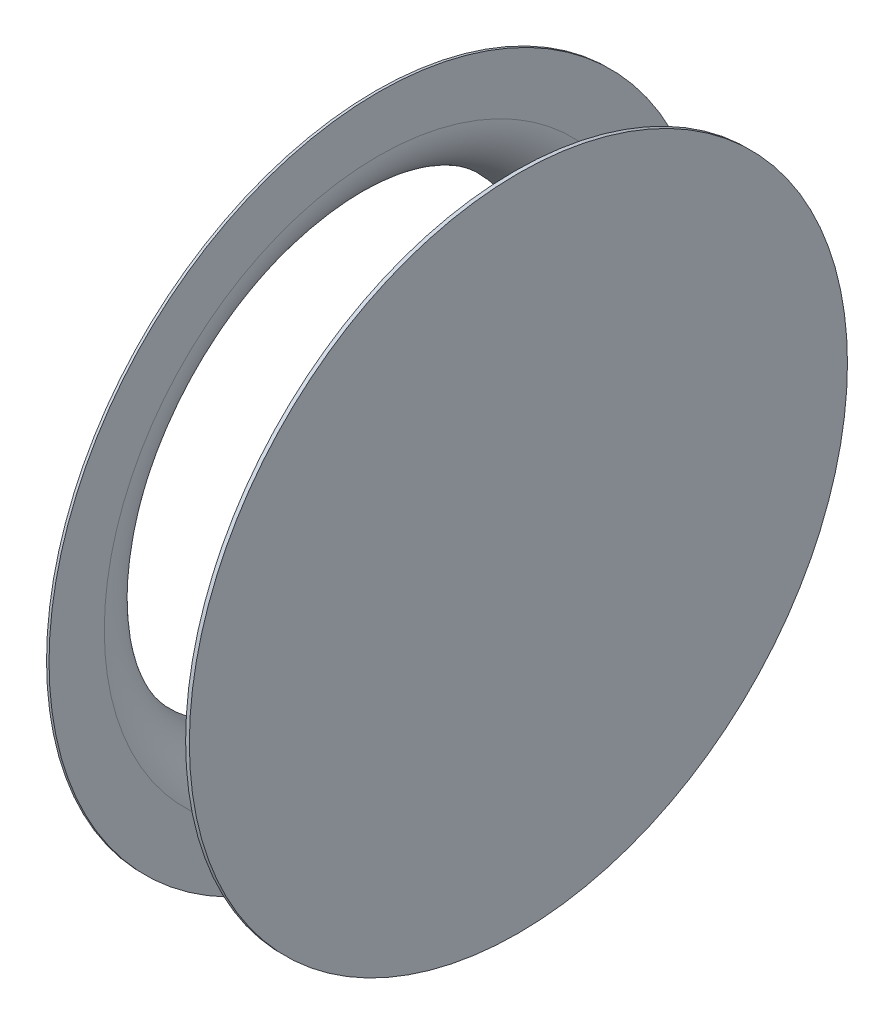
from build123d import *

# Parameters (mm, degrees)
SKIZZE3_R               = 530
LINEAR_AUSTRAGEN1_DEPTH = 6


with BuildPart() as part:
    # Skizze3 → Linear austragen1 (new body)
    with BuildSketch(Plane(origin=(0, 0, 0), x_dir=(0, -1, 0), z_dir=(1, 0, 0))):
        with Locations(Location((0, 0, 0), (0, 0, 90))):
            Circle(SKIZZE3_R)
    extrude(amount=LINEAR_AUSTRAGEN1_DEPTH)


with BuildPart() as body_2:
    # Skizze4 → Rotation1 (revolve)
    with BuildSketch(Plane(origin=(0, 0, 0), x_dir=(1, 0, 0), z_dir=(0, 1, 0)), mode=Mode.PRIVATE) as rotation1_sk:
        with BuildLine():
            Line((-224, 530), (-224, 441))
            ThreePointArc((-224, 441), (-248.895923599, 380.895923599), (-309, 356))
            Line((-309, 356), (-309, 352))
            ThreePointArc((-309, 352), (-246.067496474, 378.067496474), (-220, 441))
            Line((-220, 441), (-220, 530))
            Line((-220, 530), (-224, 530))
        make_face()
    revolve(rotation1_sk.sketch.rotate(Axis((-337.763793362, 0, 0), (1, 0, 0)), 180), axis=Axis((-337.763793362, 0, 0), (1, 0, 0)))


solid = Compound([part.part, body_2.part])
